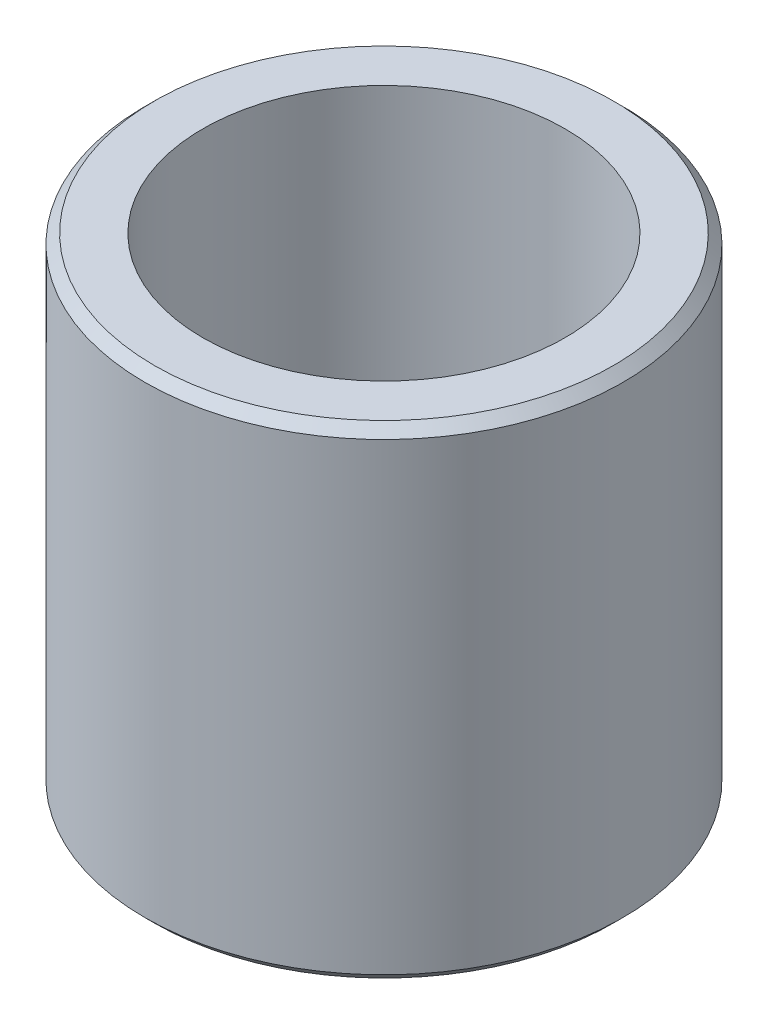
ISO-10303-21;
HEADER;
FILE_DESCRIPTION(('STEP AP214'),'2;1');
FILE_NAME('part.step','',(''),(''),'','','');
FILE_SCHEMA(('AUTOMOTIVE_DESIGN { 1 0 10303 214 1 1 1 1 }'));
ENDSEC;
DATA;
#1=APPLICATION_CONTEXT('core data for automotive mechanical design processes');
#2=APPLICATION_PROTOCOL_DEFINITION('international standard','automotive_design',2000,#1);
#3=PRODUCT_CONTEXT('',#1,'mechanical');
#4=PRODUCT('Part','Part','',(#3));
#5=PRODUCT_RELATED_PRODUCT_CATEGORY('part','',(#4));
#6=PRODUCT_DEFINITION_FORMATION('','',#4);
#7=PRODUCT_DEFINITION_CONTEXT('part definition',#1,'design');
#8=PRODUCT_DEFINITION('design','',#6,#7);
#9=PRODUCT_DEFINITION_SHAPE('','',#8);
#10=(LENGTH_UNIT() NAMED_UNIT(*) SI_UNIT(.MILLI.,.METRE.));
#11=(NAMED_UNIT(*) PLANE_ANGLE_UNIT() SI_UNIT($,.RADIAN.));
#12=(NAMED_UNIT(*) SI_UNIT($,.STERADIAN.) SOLID_ANGLE_UNIT());
#13=UNCERTAINTY_MEASURE_WITH_UNIT(LENGTH_MEASURE(1.E-05),#10,'distance_accuracy_value','');
#14=(GEOMETRIC_REPRESENTATION_CONTEXT(3) GLOBAL_UNCERTAINTY_ASSIGNED_CONTEXT((#13)) GLOBAL_UNIT_ASSIGNED_CONTEXT((#10,
#11,#12)) REPRESENTATION_CONTEXT('',''));
#15=CARTESIAN_POINT('',(0.,0.,0.));
#16=DIRECTION('',(0.,0.,1.));
#17=DIRECTION('',(1.,0.,0.));
#18=AXIS2_PLACEMENT_3D('',#15,#16,#17);
#19=CARTESIAN_POINT('',(0.,127.,0.));
#20=DIRECTION('',(0.,1.,0.));
#21=DIRECTION('',(0.,0.,1.));
#22=AXIS2_PLACEMENT_3D('',#19,#20,#21);
#23=PLANE('',#22);
#24=CARTESIAN_POINT('',(0.,127.,0.));
#25=DIRECTION('',(0.,1.,0.));
#26=DIRECTION('',(0.,0.,1.));
#27=AXIS2_PLACEMENT_3D('',#24,#25,#26);
#28=CIRCLE('',#27,60.325);
#29=CARTESIAN_POINT('',(0.,127.,60.325));
#30=VERTEX_POINT('',#29);
#31=EDGE_CURVE('E52',#30,#30,#28,.T.);
#32=ORIENTED_EDGE('',*,*,#31,.T.);
#33=EDGE_LOOP('',(#32));
#34=FACE_BOUND('',#33,.T.);
#35=CARTESIAN_POINT('',(0.,127.,0.));
#36=DIRECTION('',(0.,1.,0.));
#37=DIRECTION('',(0.,0.,1.));
#38=AXIS2_PLACEMENT_3D('',#35,#36,#37);
#39=CIRCLE('',#38,47.625);
#40=CARTESIAN_POINT('',(0.,127.,47.625));
#41=VERTEX_POINT('',#40);
#42=EDGE_CURVE('E57',#41,#41,#39,.T.);
#43=ORIENTED_EDGE('',*,*,#42,.F.);
#44=EDGE_LOOP('',(#43));
#45=FACE_BOUND('',#44,.T.);
#46=ADVANCED_FACE('F37',(#34,#45),#23,.T.);
#47=CARTESIAN_POINT('',(0.,0.,0.));
#48=DIRECTION('',(0.,1.,0.));
#49=DIRECTION('',(0.,0.,1.));
#50=AXIS2_PLACEMENT_3D('',#47,#48,#49);
#51=PLANE('',#50);
#52=CARTESIAN_POINT('',(0.,0.,0.));
#53=DIRECTION('',(0.,1.,0.));
#54=DIRECTION('',(0.,0.,1.));
#55=AXIS2_PLACEMENT_3D('',#52,#53,#54);
#56=CIRCLE('',#55,60.325);
#57=CARTESIAN_POINT('',(0.,0.,60.325));
#58=VERTEX_POINT('',#57);
#59=EDGE_CURVE('E10',#58,#58,#56,.F.);
#60=ORIENTED_EDGE('',*,*,#59,.T.);
#61=EDGE_LOOP('',(#60));
#62=FACE_BOUND('',#61,.T.);
#63=CARTESIAN_POINT('',(0.,0.,0.));
#64=DIRECTION('',(0.,1.,0.));
#65=DIRECTION('',(0.,0.,1.));
#66=AXIS2_PLACEMENT_3D('',#63,#64,#65);
#67=CIRCLE('',#66,47.625);
#68=CARTESIAN_POINT('',(0.,0.,47.625));
#69=VERTEX_POINT('',#68);
#70=EDGE_CURVE('E58',#69,#69,#67,.T.);
#71=ORIENTED_EDGE('',*,*,#70,.T.);
#72=EDGE_LOOP('',(#71));
#73=FACE_BOUND('',#72,.T.);
#74=ADVANCED_FACE('F68',(#62,#73),#51,.F.);
#75=CARTESIAN_POINT('',(0.,127.,0.));
#76=DIRECTION('',(0.,-1.,0.));
#77=DIRECTION('',(0.,0.,-1.));
#78=AXIS2_PLACEMENT_3D('',#75,#76,#77);
#79=CYLINDRICAL_SURFACE('',#78,62.865);
#80=CARTESIAN_POINT('',(0.,124.46,0.));
#81=DIRECTION('',(0.,1.,0.));
#82=DIRECTION('',(0.,0.,1.));
#83=AXIS2_PLACEMENT_3D('',#80,#81,#82);
#84=CIRCLE('',#83,62.865);
#85=CARTESIAN_POINT('',(0.,124.46,62.865));
#86=VERTEX_POINT('',#85);
#87=EDGE_CURVE('E44',#86,#86,#84,.F.);
#88=ORIENTED_EDGE('',*,*,#87,.T.);
#89=EDGE_LOOP('',(#88));
#90=FACE_BOUND('',#89,.T.);
#91=CARTESIAN_POINT('',(0.,2.54000000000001,0.));
#92=DIRECTION('',(0.,1.,0.));
#93=DIRECTION('',(0.,0.,1.));
#94=AXIS2_PLACEMENT_3D('',#91,#92,#93);
#95=CIRCLE('',#94,62.865);
#96=CARTESIAN_POINT('',(0.,2.54000000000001,62.865));
#97=VERTEX_POINT('',#96);
#98=EDGE_CURVE('E48',#97,#97,#95,.T.);
#99=ORIENTED_EDGE('',*,*,#98,.T.);
#100=EDGE_LOOP('',(#99));
#101=FACE_BOUND('',#100,.T.);
#102=ADVANCED_FACE('F74',(#90,#101),#79,.T.);
#103=CARTESIAN_POINT('',(0.,127.,0.));
#104=DIRECTION('',(0.,-1.,0.));
#105=DIRECTION('',(0.,0.,-1.));
#106=AXIS2_PLACEMENT_3D('',#103,#104,#105);
#107=CYLINDRICAL_SURFACE('',#106,47.625);
#108=ORIENTED_EDGE('',*,*,#42,.T.);
#109=EDGE_LOOP('',(#108));
#110=FACE_BOUND('',#109,.T.);
#111=ORIENTED_EDGE('',*,*,#70,.F.);
#112=EDGE_LOOP('',(#111));
#113=FACE_BOUND('',#112,.T.);
#114=ADVANCED_FACE('F64',(#110,#113),#107,.F.);
#115=CARTESIAN_POINT('',(0.,127.,0.));
#116=DIRECTION('',(0.,-1.,0.));
#117=DIRECTION('',(0.,0.,-1.));
#118=AXIS2_PLACEMENT_3D('',#115,#116,#117);
#119=CONICAL_SURFACE('',#118,60.325,0.78539816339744);
#120=ORIENTED_EDGE('',*,*,#87,.F.);
#121=EDGE_LOOP('',(#120));
#122=FACE_BOUND('',#121,.T.);
#123=ORIENTED_EDGE('',*,*,#31,.F.);
#124=EDGE_LOOP('',(#123));
#125=FACE_BOUND('',#124,.T.);
#126=ADVANCED_FACE('F79',(#122,#125),#119,.T.);
#127=CARTESIAN_POINT('',(0.,2.54000000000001,0.));
#128=DIRECTION('',(0.,1.,0.));
#129=DIRECTION('',(0.,0.,1.));
#130=AXIS2_PLACEMENT_3D('',#127,#128,#129);
#131=CONICAL_SURFACE('',#130,62.865,0.785398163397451);
#132=ORIENTED_EDGE('',*,*,#59,.F.);
#133=EDGE_LOOP('',(#132));
#134=FACE_BOUND('',#133,.T.);
#135=ORIENTED_EDGE('',*,*,#98,.F.);
#136=EDGE_LOOP('',(#135));
#137=FACE_BOUND('',#136,.T.);
#138=ADVANCED_FACE('F39',(#134,#137),#131,.T.);
#139=CLOSED_SHELL('',(#46,#74,#102,#114,#126,#138));
#140=MANIFOLD_SOLID_BREP('B2',#139);
#141=ADVANCED_BREP_SHAPE_REPRESENTATION('',(#18,#140),#14);
#142=SHAPE_DEFINITION_REPRESENTATION(#9,#141);
ENDSEC;
END-ISO-10303-21;
